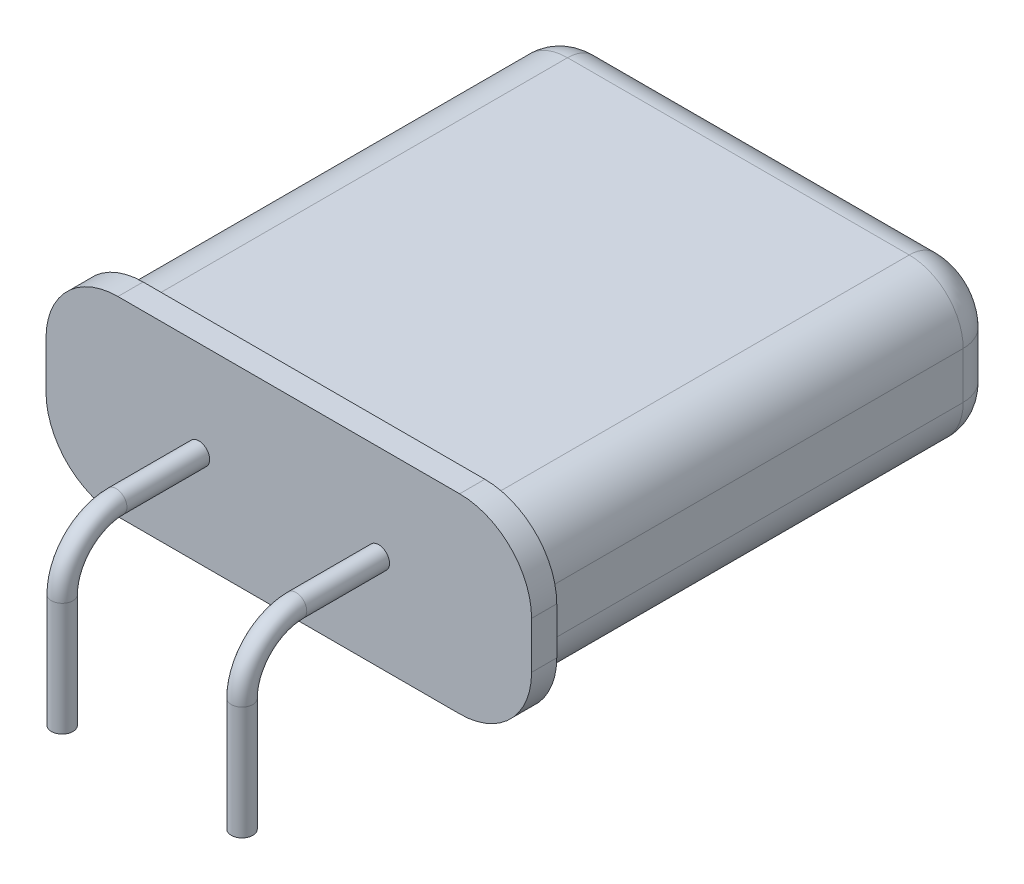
ISO-10303-21;
HEADER;
FILE_DESCRIPTION(('STEP AP214'),'2;1');
FILE_NAME('part.step','',(''),(''),'','','');
FILE_SCHEMA(('AUTOMOTIVE_DESIGN { 1 0 10303 214 1 1 1 1 }'));
ENDSEC;
DATA;
#1=APPLICATION_CONTEXT('core data for automotive mechanical design processes');
#2=APPLICATION_PROTOCOL_DEFINITION('international standard','automotive_design',2000,#1);
#3=PRODUCT_CONTEXT('',#1,'mechanical');
#4=PRODUCT('Part','Part','',(#3));
#5=PRODUCT_RELATED_PRODUCT_CATEGORY('part','',(#4));
#6=PRODUCT_DEFINITION_FORMATION('','',#4);
#7=PRODUCT_DEFINITION_CONTEXT('part definition',#1,'design');
#8=PRODUCT_DEFINITION('design','',#6,#7);
#9=PRODUCT_DEFINITION_SHAPE('','',#8);
#10=(LENGTH_UNIT() NAMED_UNIT(*) SI_UNIT(.MILLI.,.METRE.));
#11=(NAMED_UNIT(*) PLANE_ANGLE_UNIT() SI_UNIT($,.RADIAN.));
#12=(NAMED_UNIT(*) SI_UNIT($,.STERADIAN.) SOLID_ANGLE_UNIT());
#13=UNCERTAINTY_MEASURE_WITH_UNIT(LENGTH_MEASURE(1.E-05),#10,'distance_accuracy_value','');
#14=(GEOMETRIC_REPRESENTATION_CONTEXT(3) GLOBAL_UNCERTAINTY_ASSIGNED_CONTEXT((#13)) GLOBAL_UNIT_ASSIGNED_CONTEXT((#10,
#11,#12)) REPRESENTATION_CONTEXT('',''));
#15=CARTESIAN_POINT('',(0.,0.,0.));
#16=DIRECTION('',(0.,0.,1.));
#17=DIRECTION('',(1.,0.,0.));
#18=AXIS2_PLACEMENT_3D('',#15,#16,#17);
#19=CARTESIAN_POINT('',(2.,3.3,0.));
#20=DIRECTION('',(0.,0.,-1.));
#21=DIRECTION('',(-1.,0.,0.));
#22=AXIS2_PLACEMENT_3D('',#19,#20,#21);
#23=PLANE('',#22);
#24=CARTESIAN_POINT('',(9.25,2.65,0.));
#25=DIRECTION('',(0.,0.,1.));
#26=DIRECTION('',(1.,0.,0.));
#27=AXIS2_PLACEMENT_3D('',#24,#25,#26);
#28=CIRCLE('',#27,0.3);
#29=CARTESIAN_POINT('',(9.55,2.65,0.));
#30=VERTEX_POINT('',#29);
#31=EDGE_CURVE('E47',#30,#30,#28,.T.);
#32=ORIENTED_EDGE('',*,*,#31,.F.);
#33=EDGE_LOOP('',(#32));
#34=FACE_BOUND('',#33,.T.);
#35=CARTESIAN_POINT('',(2.,3.3,0.));
#36=DIRECTION('',(0.,0.,1.));
#37=DIRECTION('',(-1.,0.,0.));
#38=AXIS2_PLACEMENT_3D('',#35,#36,#37);
#39=CIRCLE('',#38,2.);
#40=CARTESIAN_POINT('',(2.,5.3,0.));
#41=VERTEX_POINT('',#40);
#42=CARTESIAN_POINT('',(0.,3.3,0.));
#43=VERTEX_POINT('',#42);
#44=EDGE_CURVE('E189',#41,#43,#39,.T.);
#45=ORIENTED_EDGE('',*,*,#44,.T.);
#46=DIRECTION('',(0.,-1.,0.));
#47=VECTOR('',#46,1.);
#48=CARTESIAN_POINT('',(0.,2.,0.));
#49=LINE('',#48,#47);
#50=CARTESIAN_POINT('',(0.,2.,0.));
#51=VERTEX_POINT('',#50);
#52=EDGE_CURVE('E256',#43,#51,#49,.T.);
#53=ORIENTED_EDGE('',*,*,#52,.T.);
#54=CARTESIAN_POINT('',(2.,2.,0.));
#55=DIRECTION('',(0.,0.,1.));
#56=DIRECTION('',(-1.,0.,0.));
#57=AXIS2_PLACEMENT_3D('',#54,#55,#56);
#58=CIRCLE('',#57,2.);
#59=CARTESIAN_POINT('',(2.,0.,0.));
#60=VERTEX_POINT('',#59);
#61=EDGE_CURVE('E260',#51,#60,#58,.T.);
#62=ORIENTED_EDGE('',*,*,#61,.T.);
#63=DIRECTION('',(1.,0.,0.));
#64=VECTOR('',#63,1.);
#65=CARTESIAN_POINT('',(2.,0.,0.));
#66=LINE('',#65,#64);
#67=CARTESIAN_POINT('',(11.5,0.,0.));
#68=VERTEX_POINT('',#67);
#69=EDGE_CURVE('E264',#60,#68,#66,.T.);
#70=ORIENTED_EDGE('',*,*,#69,.T.);
#71=CARTESIAN_POINT('',(11.5,2.,0.));
#72=DIRECTION('',(0.,0.,1.));
#73=DIRECTION('',(1.,0.,0.));
#74=AXIS2_PLACEMENT_3D('',#71,#72,#73);
#75=CIRCLE('',#74,2.);
#76=CARTESIAN_POINT('',(13.5,2.,0.));
#77=VERTEX_POINT('',#76);
#78=EDGE_CURVE('E268',#68,#77,#75,.T.);
#79=ORIENTED_EDGE('',*,*,#78,.T.);
#80=DIRECTION('',(0.,1.,0.));
#81=VECTOR('',#80,1.);
#82=CARTESIAN_POINT('',(13.5,2.,0.));
#83=LINE('',#82,#81);
#84=CARTESIAN_POINT('',(13.5,3.3,0.));
#85=VERTEX_POINT('',#84);
#86=EDGE_CURVE('E272',#77,#85,#83,.T.);
#87=ORIENTED_EDGE('',*,*,#86,.T.);
#88=CARTESIAN_POINT('',(11.5,3.3,0.));
#89=DIRECTION('',(0.,0.,1.));
#90=DIRECTION('',(-1.,0.,0.));
#91=AXIS2_PLACEMENT_3D('',#88,#89,#90);
#92=CIRCLE('',#91,2.);
#93=CARTESIAN_POINT('',(11.5,5.3,0.));
#94=VERTEX_POINT('',#93);
#95=EDGE_CURVE('E276',#85,#94,#92,.T.);
#96=ORIENTED_EDGE('',*,*,#95,.T.);
#97=DIRECTION('',(-1.,0.,0.));
#98=VECTOR('',#97,1.);
#99=CARTESIAN_POINT('',(2.,5.3,0.));
#100=LINE('',#99,#98);
#101=EDGE_CURVE('E280',#94,#41,#100,.T.);
#102=ORIENTED_EDGE('',*,*,#101,.T.);
#103=EDGE_LOOP('',(#45,#53,#62,#70,#79,#87,#96,#102));
#104=FACE_BOUND('',#103,.T.);
#105=CARTESIAN_POINT('',(4.25,2.65,0.));
#106=DIRECTION('',(0.,0.,1.));
#107=DIRECTION('',(-1.,0.,0.));
#108=AXIS2_PLACEMENT_3D('',#105,#106,#107);
#109=CIRCLE('',#108,0.3);
#110=CARTESIAN_POINT('',(3.95,2.65,0.));
#111=VERTEX_POINT('',#110);
#112=EDGE_CURVE('E11',#111,#111,#109,.T.);
#113=ORIENTED_EDGE('',*,*,#112,.F.);
#114=EDGE_LOOP('',(#113));
#115=FACE_BOUND('',#114,.T.);
#116=ADVANCED_FACE('F37',(#34,#104,#115),#23,.F.);
#117=CARTESIAN_POINT('',(2.,3.3,-0.7));
#118=DIRECTION('',(0.,0.,-1.));
#119=DIRECTION('',(-1.,0.,0.));
#120=AXIS2_PLACEMENT_3D('',#117,#118,#119);
#121=PLANE('',#120);
#122=CARTESIAN_POINT('',(2.,3.3,-0.7));
#123=DIRECTION('',(0.,0.,1.));
#124=DIRECTION('',(-1.,0.,0.));
#125=AXIS2_PLACEMENT_3D('',#122,#123,#124);
#126=CIRCLE('',#125,2.);
#127=CARTESIAN_POINT('',(2.,5.3,-0.7));
#128=VERTEX_POINT('',#127);
#129=CARTESIAN_POINT('',(0.,3.3,-0.7));
#130=VERTEX_POINT('',#129);
#131=EDGE_CURVE('E284',#128,#130,#126,.T.);
#132=ORIENTED_EDGE('',*,*,#131,.F.);
#133=DIRECTION('',(-1.,0.,0.));
#134=VECTOR('',#133,1.);
#135=CARTESIAN_POINT('',(2.,5.3,-0.7));
#136=LINE('',#135,#134);
#137=CARTESIAN_POINT('',(11.5,5.3,-0.7));
#138=VERTEX_POINT('',#137);
#139=EDGE_CURVE('E312',#138,#128,#136,.T.);
#140=ORIENTED_EDGE('',*,*,#139,.F.);
#141=CARTESIAN_POINT('',(11.5,3.3,-0.7));
#142=DIRECTION('',(0.,0.,1.));
#143=DIRECTION('',(-1.,0.,0.));
#144=AXIS2_PLACEMENT_3D('',#141,#142,#143);
#145=CIRCLE('',#144,2.);
#146=CARTESIAN_POINT('',(13.5,3.3,-0.7));
#147=VERTEX_POINT('',#146);
#148=EDGE_CURVE('E308',#147,#138,#145,.T.);
#149=ORIENTED_EDGE('',*,*,#148,.F.);
#150=DIRECTION('',(0.,1.,0.));
#151=VECTOR('',#150,1.);
#152=CARTESIAN_POINT('',(13.5,2.,-0.7));
#153=LINE('',#152,#151);
#154=CARTESIAN_POINT('',(13.5,2.,-0.7));
#155=VERTEX_POINT('',#154);
#156=EDGE_CURVE('E304',#155,#147,#153,.T.);
#157=ORIENTED_EDGE('',*,*,#156,.F.);
#158=CARTESIAN_POINT('',(11.5,2.,-0.7));
#159=DIRECTION('',(0.,0.,1.));
#160=DIRECTION('',(1.,0.,0.));
#161=AXIS2_PLACEMENT_3D('',#158,#159,#160);
#162=CIRCLE('',#161,2.);
#163=CARTESIAN_POINT('',(11.5,0.,-0.7));
#164=VERTEX_POINT('',#163);
#165=EDGE_CURVE('E300',#164,#155,#162,.T.);
#166=ORIENTED_EDGE('',*,*,#165,.F.);
#167=DIRECTION('',(1.,0.,0.));
#168=VECTOR('',#167,1.);
#169=CARTESIAN_POINT('',(2.,0.,-0.7));
#170=LINE('',#169,#168);
#171=CARTESIAN_POINT('',(2.,0.,-0.7));
#172=VERTEX_POINT('',#171);
#173=EDGE_CURVE('E296',#172,#164,#170,.T.);
#174=ORIENTED_EDGE('',*,*,#173,.F.);
#175=CARTESIAN_POINT('',(2.,2.,-0.7));
#176=DIRECTION('',(0.,0.,1.));
#177=DIRECTION('',(-1.,0.,0.));
#178=AXIS2_PLACEMENT_3D('',#175,#176,#177);
#179=CIRCLE('',#178,2.);
#180=CARTESIAN_POINT('',(0.,2.,-0.7));
#181=VERTEX_POINT('',#180);
#182=EDGE_CURVE('E292',#181,#172,#179,.T.);
#183=ORIENTED_EDGE('',*,*,#182,.F.);
#184=DIRECTION('',(0.,-1.,0.));
#185=VECTOR('',#184,1.);
#186=CARTESIAN_POINT('',(0.,2.,-0.7));
#187=LINE('',#186,#185);
#188=EDGE_CURVE('E288',#130,#181,#187,.T.);
#189=ORIENTED_EDGE('',*,*,#188,.F.);
#190=EDGE_LOOP('',(#132,#140,#149,#157,#166,#174,#183,#189));
#191=FACE_BOUND('',#190,.T.);
#192=DIRECTION('',(1.,0.,0.));
#193=VECTOR('',#192,1.);
#194=CARTESIAN_POINT('',(2.,4.8,-0.7));
#195=LINE('',#194,#193);
#196=CARTESIAN_POINT('',(2.,4.8,-0.7));
#197=VERTEX_POINT('',#196);
#198=CARTESIAN_POINT('',(11.5,4.8,-0.7));
#199=VERTEX_POINT('',#198);
#200=EDGE_CURVE('E182',#197,#199,#195,.T.);
#201=ORIENTED_EDGE('',*,*,#200,.F.);
#202=CARTESIAN_POINT('',(2.,3.3,-0.7));
#203=DIRECTION('',(0.,0.,-1.));
#204=DIRECTION('',(-1.,0.,0.));
#205=AXIS2_PLACEMENT_3D('',#202,#203,#204);
#206=CIRCLE('',#205,1.5);
#207=CARTESIAN_POINT('',(0.5,3.3,-0.7));
#208=VERTEX_POINT('',#207);
#209=EDGE_CURVE('E193',#208,#197,#206,.T.);
#210=ORIENTED_EDGE('',*,*,#209,.F.);
#211=DIRECTION('',(0.,1.,0.));
#212=VECTOR('',#211,1.);
#213=CARTESIAN_POINT('',(0.5,2.,-0.7));
#214=LINE('',#213,#212);
#215=CARTESIAN_POINT('',(0.5,2.,-0.7));
#216=VERTEX_POINT('',#215);
#217=EDGE_CURVE('E231',#216,#208,#214,.T.);
#218=ORIENTED_EDGE('',*,*,#217,.F.);
#219=CARTESIAN_POINT('',(2.,2.,-0.7));
#220=DIRECTION('',(0.,0.,-1.));
#221=DIRECTION('',(-1.,0.,0.));
#222=AXIS2_PLACEMENT_3D('',#219,#220,#221);
#223=CIRCLE('',#222,1.5);
#224=CARTESIAN_POINT('',(2.,0.5,-0.7));
#225=VERTEX_POINT('',#224);
#226=EDGE_CURVE('E227',#225,#216,#223,.T.);
#227=ORIENTED_EDGE('',*,*,#226,.F.);
#228=DIRECTION('',(-1.,0.,0.));
#229=VECTOR('',#228,1.);
#230=CARTESIAN_POINT('',(11.5,0.499999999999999,-0.7));
#231=LINE('',#230,#229);
#232=CARTESIAN_POINT('',(11.5,0.499999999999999,-0.7));
#233=VERTEX_POINT('',#232);
#234=EDGE_CURVE('E223',#233,#225,#231,.T.);
#235=ORIENTED_EDGE('',*,*,#234,.F.);
#236=CARTESIAN_POINT('',(11.5,2.,-0.7));
#237=DIRECTION('',(0.,0.,-1.));
#238=DIRECTION('',(-1.,0.,0.));
#239=AXIS2_PLACEMENT_3D('',#236,#237,#238);
#240=CIRCLE('',#239,1.5);
#241=CARTESIAN_POINT('',(13.,2.,-0.7));
#242=VERTEX_POINT('',#241);
#243=EDGE_CURVE('E219',#242,#233,#240,.T.);
#244=ORIENTED_EDGE('',*,*,#243,.F.);
#245=DIRECTION('',(0.,-1.,0.));
#246=VECTOR('',#245,1.);
#247=CARTESIAN_POINT('',(13.,3.3,-0.7));
#248=LINE('',#247,#246);
#249=CARTESIAN_POINT('',(13.,3.3,-0.7));
#250=VERTEX_POINT('',#249);
#251=EDGE_CURVE('E212',#250,#242,#248,.T.);
#252=ORIENTED_EDGE('',*,*,#251,.F.);
#253=CARTESIAN_POINT('',(11.5,3.3,-0.7));
#254=DIRECTION('',(0.,0.,-1.));
#255=DIRECTION('',(-1.,0.,0.));
#256=AXIS2_PLACEMENT_3D('',#253,#254,#255);
#257=CIRCLE('',#256,1.5);
#258=EDGE_CURVE('E206',#199,#250,#257,.T.);
#259=ORIENTED_EDGE('',*,*,#258,.F.);
#260=EDGE_LOOP('',(#201,#210,#218,#227,#235,#244,#252,#259));
#261=FACE_BOUND('',#260,.T.);
#262=ADVANCED_FACE('F203',(#191,#261),#121,.T.);
#263=CARTESIAN_POINT('',(2.,3.3,-0.7));
#264=DIRECTION('',(0.,0.,1.));
#265=DIRECTION('',(1.,0.,0.));
#266=AXIS2_PLACEMENT_3D('',#263,#264,#265);
#267=CYLINDRICAL_SURFACE('',#266,2.);
#268=ORIENTED_EDGE('',*,*,#44,.F.);
#269=DIRECTION('',(0.,0.,1.));
#270=VECTOR('',#269,1.);
#271=CARTESIAN_POINT('',(2.,5.3,-0.7));
#272=LINE('',#271,#270);
#273=EDGE_CURVE('E317',#128,#41,#272,.T.);
#274=ORIENTED_EDGE('',*,*,#273,.F.);
#275=ORIENTED_EDGE('',*,*,#131,.T.);
#276=DIRECTION('',(0.,0.,1.));
#277=VECTOR('',#276,1.);
#278=CARTESIAN_POINT('',(0.,3.3,-0.7));
#279=LINE('',#278,#277);
#280=EDGE_CURVE('E316',#130,#43,#279,.T.);
#281=ORIENTED_EDGE('',*,*,#280,.T.);
#282=EDGE_LOOP('',(#268,#274,#275,#281));
#283=FACE_BOUND('',#282,.T.);
#284=ADVANCED_FACE('F39',(#283),#267,.T.);
#285=CARTESIAN_POINT('',(2.,5.3,-0.7));
#286=DIRECTION('',(0.,1.,0.));
#287=DIRECTION('',(-1.,0.,0.));
#288=AXIS2_PLACEMENT_3D('',#285,#286,#287);
#289=PLANE('',#288);
#290=ORIENTED_EDGE('',*,*,#101,.F.);
#291=DIRECTION('',(0.,0.,1.));
#292=VECTOR('',#291,1.);
#293=CARTESIAN_POINT('',(11.5,5.3,-0.7));
#294=LINE('',#293,#292);
#295=EDGE_CURVE('E321',#138,#94,#294,.T.);
#296=ORIENTED_EDGE('',*,*,#295,.F.);
#297=ORIENTED_EDGE('',*,*,#139,.T.);
#298=ORIENTED_EDGE('',*,*,#273,.T.);
#299=EDGE_LOOP('',(#290,#296,#297,#298));
#300=FACE_BOUND('',#299,.T.);
#301=ADVANCED_FACE('F500',(#300),#289,.T.);
#302=CARTESIAN_POINT('',(11.5,3.3,-0.7));
#303=DIRECTION('',(0.,0.,1.));
#304=DIRECTION('',(1.,0.,0.));
#305=AXIS2_PLACEMENT_3D('',#302,#303,#304);
#306=CYLINDRICAL_SURFACE('',#305,2.);
#307=ORIENTED_EDGE('',*,*,#95,.F.);
#308=DIRECTION('',(0.,0.,1.));
#309=VECTOR('',#308,1.);
#310=CARTESIAN_POINT('',(13.5,3.3,-0.7));
#311=LINE('',#310,#309);
#312=EDGE_CURVE('E324',#147,#85,#311,.T.);
#313=ORIENTED_EDGE('',*,*,#312,.F.);
#314=ORIENTED_EDGE('',*,*,#148,.T.);
#315=ORIENTED_EDGE('',*,*,#295,.T.);
#316=EDGE_LOOP('',(#307,#313,#314,#315));
#317=FACE_BOUND('',#316,.T.);
#318=ADVANCED_FACE('F503',(#317),#306,.T.);
#319=CARTESIAN_POINT('',(13.5,2.,-0.7));
#320=DIRECTION('',(1.,0.,0.));
#321=DIRECTION('',(0.,0.,-1.));
#322=AXIS2_PLACEMENT_3D('',#319,#320,#321);
#323=PLANE('',#322);
#324=ORIENTED_EDGE('',*,*,#86,.F.);
#325=DIRECTION('',(0.,0.,1.));
#326=VECTOR('',#325,1.);
#327=CARTESIAN_POINT('',(13.5,2.,-0.7));
#328=LINE('',#327,#326);
#329=EDGE_CURVE('E327',#155,#77,#328,.T.);
#330=ORIENTED_EDGE('',*,*,#329,.F.);
#331=ORIENTED_EDGE('',*,*,#156,.T.);
#332=ORIENTED_EDGE('',*,*,#312,.T.);
#333=EDGE_LOOP('',(#324,#330,#331,#332));
#334=FACE_BOUND('',#333,.T.);
#335=ADVANCED_FACE('F507',(#334),#323,.T.);
#336=CARTESIAN_POINT('',(11.5,2.,-0.7));
#337=DIRECTION('',(0.,0.,1.));
#338=DIRECTION('',(1.,0.,0.));
#339=AXIS2_PLACEMENT_3D('',#336,#337,#338);
#340=CYLINDRICAL_SURFACE('',#339,2.);
#341=ORIENTED_EDGE('',*,*,#78,.F.);
#342=DIRECTION('',(0.,0.,1.));
#343=VECTOR('',#342,1.);
#344=CARTESIAN_POINT('',(11.5,0.,-0.7));
#345=LINE('',#344,#343);
#346=EDGE_CURVE('E330',#164,#68,#345,.T.);
#347=ORIENTED_EDGE('',*,*,#346,.F.);
#348=ORIENTED_EDGE('',*,*,#165,.T.);
#349=ORIENTED_EDGE('',*,*,#329,.T.);
#350=EDGE_LOOP('',(#341,#347,#348,#349));
#351=FACE_BOUND('',#350,.T.);
#352=ADVANCED_FACE('F511',(#351),#340,.T.);
#353=CARTESIAN_POINT('',(2.,0.,-0.7));
#354=DIRECTION('',(0.,-1.,0.));
#355=DIRECTION('',(0.,0.,-1.));
#356=AXIS2_PLACEMENT_3D('',#353,#354,#355);
#357=PLANE('',#356);
#358=ORIENTED_EDGE('',*,*,#69,.F.);
#359=DIRECTION('',(0.,0.,1.));
#360=VECTOR('',#359,1.);
#361=CARTESIAN_POINT('',(2.,0.,-0.7));
#362=LINE('',#361,#360);
#363=EDGE_CURVE('E333',#172,#60,#362,.T.);
#364=ORIENTED_EDGE('',*,*,#363,.F.);
#365=ORIENTED_EDGE('',*,*,#173,.T.);
#366=ORIENTED_EDGE('',*,*,#346,.T.);
#367=EDGE_LOOP('',(#358,#364,#365,#366));
#368=FACE_BOUND('',#367,.T.);
#369=ADVANCED_FACE('F515',(#368),#357,.T.);
#370=CARTESIAN_POINT('',(2.,2.,-0.7));
#371=DIRECTION('',(0.,0.,1.));
#372=DIRECTION('',(1.,0.,0.));
#373=AXIS2_PLACEMENT_3D('',#370,#371,#372);
#374=CYLINDRICAL_SURFACE('',#373,2.);
#375=ORIENTED_EDGE('',*,*,#61,.F.);
#376=DIRECTION('',(0.,0.,1.));
#377=VECTOR('',#376,1.);
#378=CARTESIAN_POINT('',(0.,2.,-0.7));
#379=LINE('',#378,#377);
#380=EDGE_CURVE('E336',#181,#51,#379,.T.);
#381=ORIENTED_EDGE('',*,*,#380,.F.);
#382=ORIENTED_EDGE('',*,*,#182,.T.);
#383=ORIENTED_EDGE('',*,*,#363,.T.);
#384=EDGE_LOOP('',(#375,#381,#382,#383));
#385=FACE_BOUND('',#384,.T.);
#386=ADVANCED_FACE('F519',(#385),#374,.T.);
#387=CARTESIAN_POINT('',(0.,2.,-0.7));
#388=DIRECTION('',(-1.,0.,0.));
#389=DIRECTION('',(0.,0.,1.));
#390=AXIS2_PLACEMENT_3D('',#387,#388,#389);
#391=PLANE('',#390);
#392=ORIENTED_EDGE('',*,*,#52,.F.);
#393=ORIENTED_EDGE('',*,*,#280,.F.);
#394=ORIENTED_EDGE('',*,*,#188,.T.);
#395=ORIENTED_EDGE('',*,*,#380,.T.);
#396=EDGE_LOOP('',(#392,#393,#394,#395));
#397=FACE_BOUND('',#396,.T.);
#398=ADVANCED_FACE('F522',(#397),#391,.T.);
#399=CARTESIAN_POINT('',(2.,3.3,-13.5));
#400=DIRECTION('',(0.,0.,1.));
#401=DIRECTION('',(1.,0.,0.));
#402=AXIS2_PLACEMENT_3D('',#399,#400,#401);
#403=CYLINDRICAL_SURFACE('',#402,1.5);
#404=DIRECTION('',(0.,0.,1.));
#405=VECTOR('',#404,1.);
#406=CARTESIAN_POINT('',(2.,4.8,-13.5));
#407=LINE('',#406,#405);
#408=CARTESIAN_POINT('',(2.,4.8,-12.5));
#409=VERTEX_POINT('',#408);
#410=EDGE_CURVE('E178',#409,#197,#407,.T.);
#411=ORIENTED_EDGE('',*,*,#410,.F.);
#412=CARTESIAN_POINT('',(2.,3.3,-12.5));
#413=DIRECTION('',(0.,0.,-1.));
#414=DIRECTION('',(-1.,0.,0.));
#415=AXIS2_PLACEMENT_3D('',#412,#413,#414);
#416=CIRCLE('',#415,1.5);
#417=CARTESIAN_POINT('',(0.5,3.3,-12.5));
#418=VERTEX_POINT('',#417);
#419=EDGE_CURVE('E365',#409,#418,#416,.F.);
#420=ORIENTED_EDGE('',*,*,#419,.T.);
#421=DIRECTION('',(0.,0.,1.));
#422=VECTOR('',#421,1.);
#423=CARTESIAN_POINT('',(0.5,3.3,-13.5));
#424=LINE('',#423,#422);
#425=EDGE_CURVE('E196',#418,#208,#424,.T.);
#426=ORIENTED_EDGE('',*,*,#425,.T.);
#427=ORIENTED_EDGE('',*,*,#209,.T.);
#428=EDGE_LOOP('',(#411,#420,#426,#427));
#429=FACE_BOUND('',#428,.T.);
#430=ADVANCED_FACE('F194',(#429),#403,.T.);
#431=CARTESIAN_POINT('',(2.,4.8,-13.5));
#432=DIRECTION('',(0.,-1.,0.));
#433=DIRECTION('',(0.,0.,-1.));
#434=AXIS2_PLACEMENT_3D('',#431,#432,#433);
#435=PLANE('',#434);
#436=DIRECTION('',(0.,0.,1.));
#437=VECTOR('',#436,1.);
#438=CARTESIAN_POINT('',(11.5,4.8,-13.5));
#439=LINE('',#438,#437);
#440=CARTESIAN_POINT('',(11.5,4.8,-12.5));
#441=VERTEX_POINT('',#440);
#442=EDGE_CURVE('E190',#441,#199,#439,.T.);
#443=ORIENTED_EDGE('',*,*,#442,.F.);
#444=DIRECTION('',(1.,0.,0.));
#445=VECTOR('',#444,1.);
#446=CARTESIAN_POINT('',(2.,4.8,-12.5));
#447=LINE('',#446,#445);
#448=EDGE_CURVE('E41',#441,#409,#447,.F.);
#449=ORIENTED_EDGE('',*,*,#448,.T.);
#450=ORIENTED_EDGE('',*,*,#410,.T.);
#451=ORIENTED_EDGE('',*,*,#200,.T.);
#452=EDGE_LOOP('',(#443,#449,#450,#451));
#453=FACE_BOUND('',#452,.T.);
#454=ADVANCED_FACE('F180',(#453),#435,.F.);
#455=CARTESIAN_POINT('',(11.5,3.3,-13.5));
#456=DIRECTION('',(0.,0.,1.));
#457=DIRECTION('',(1.,0.,0.));
#458=AXIS2_PLACEMENT_3D('',#455,#456,#457);
#459=CYLINDRICAL_SURFACE('',#458,1.5);
#460=DIRECTION('',(0.,0.,1.));
#461=VECTOR('',#460,1.);
#462=CARTESIAN_POINT('',(13.,3.3,-13.5));
#463=LINE('',#462,#461);
#464=CARTESIAN_POINT('',(13.,3.3,-12.5));
#465=VERTEX_POINT('',#464);
#466=EDGE_CURVE('E248',#465,#250,#463,.T.);
#467=ORIENTED_EDGE('',*,*,#466,.F.);
#468=CARTESIAN_POINT('',(11.5,3.3,-12.5));
#469=DIRECTION('',(0.,0.,-1.));
#470=DIRECTION('',(-1.,0.,0.));
#471=AXIS2_PLACEMENT_3D('',#468,#469,#470);
#472=CIRCLE('',#471,1.5);
#473=EDGE_CURVE('E55',#465,#441,#472,.F.);
#474=ORIENTED_EDGE('',*,*,#473,.T.);
#475=ORIENTED_EDGE('',*,*,#442,.T.);
#476=ORIENTED_EDGE('',*,*,#258,.T.);
#477=EDGE_LOOP('',(#467,#474,#475,#476));
#478=FACE_BOUND('',#477,.T.);
#479=ADVANCED_FACE('F586',(#478),#459,.T.);
#480=CARTESIAN_POINT('',(13.,3.3,-13.5));
#481=DIRECTION('',(-1.,0.,0.));
#482=DIRECTION('',(0.,0.,1.));
#483=AXIS2_PLACEMENT_3D('',#480,#481,#482);
#484=PLANE('',#483);
#485=DIRECTION('',(0.,0.,1.));
#486=VECTOR('',#485,1.);
#487=CARTESIAN_POINT('',(13.,2.,-13.5));
#488=LINE('',#487,#486);
#489=CARTESIAN_POINT('',(13.,2.,-12.5));
#490=VERTEX_POINT('',#489);
#491=EDGE_CURVE('E245',#490,#242,#488,.T.);
#492=ORIENTED_EDGE('',*,*,#491,.F.);
#493=DIRECTION('',(0.,-1.,0.));
#494=VECTOR('',#493,1.);
#495=CARTESIAN_POINT('',(13.,3.3,-12.5));
#496=LINE('',#495,#494);
#497=EDGE_CURVE('E63',#490,#465,#496,.F.);
#498=ORIENTED_EDGE('',*,*,#497,.T.);
#499=ORIENTED_EDGE('',*,*,#466,.T.);
#500=ORIENTED_EDGE('',*,*,#251,.T.);
#501=EDGE_LOOP('',(#492,#498,#499,#500));
#502=FACE_BOUND('',#501,.T.);
#503=ADVANCED_FACE('F441',(#502),#484,.F.);
#504=CARTESIAN_POINT('',(11.5,2.,-13.5));
#505=DIRECTION('',(0.,0.,1.));
#506=DIRECTION('',(1.,0.,0.));
#507=AXIS2_PLACEMENT_3D('',#504,#505,#506);
#508=CYLINDRICAL_SURFACE('',#507,1.5);
#509=DIRECTION('',(0.,0.,1.));
#510=VECTOR('',#509,1.);
#511=CARTESIAN_POINT('',(11.5,0.499999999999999,-13.5));
#512=LINE('',#511,#510);
#513=CARTESIAN_POINT('',(11.5,0.499999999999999,-12.5));
#514=VERTEX_POINT('',#513);
#515=EDGE_CURVE('E242',#514,#233,#512,.T.);
#516=ORIENTED_EDGE('',*,*,#515,.F.);
#517=CARTESIAN_POINT('',(11.5,2.,-12.5));
#518=DIRECTION('',(0.,0.,-1.));
#519=DIRECTION('',(-1.,0.,0.));
#520=AXIS2_PLACEMENT_3D('',#517,#518,#519);
#521=CIRCLE('',#520,1.5);
#522=EDGE_CURVE('E377',#514,#490,#521,.F.);
#523=ORIENTED_EDGE('',*,*,#522,.T.);
#524=ORIENTED_EDGE('',*,*,#491,.T.);
#525=ORIENTED_EDGE('',*,*,#243,.T.);
#526=EDGE_LOOP('',(#516,#523,#524,#525));
#527=FACE_BOUND('',#526,.T.);
#528=ADVANCED_FACE('F440',(#527),#508,.T.);
#529=CARTESIAN_POINT('',(11.5,0.499999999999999,-13.5));
#530=DIRECTION('',(0.,1.,0.));
#531=DIRECTION('',(-1.,0.,0.));
#532=AXIS2_PLACEMENT_3D('',#529,#530,#531);
#533=PLANE('',#532);
#534=DIRECTION('',(0.,0.,1.));
#535=VECTOR('',#534,1.);
#536=CARTESIAN_POINT('',(2.,0.5,-13.5));
#537=LINE('',#536,#535);
#538=CARTESIAN_POINT('',(2.,0.5,-12.5));
#539=VERTEX_POINT('',#538);
#540=EDGE_CURVE('E239',#539,#225,#537,.T.);
#541=ORIENTED_EDGE('',*,*,#540,.F.);
#542=DIRECTION('',(-1.,0.,0.));
#543=VECTOR('',#542,1.);
#544=CARTESIAN_POINT('',(11.5,0.499999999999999,-12.5));
#545=LINE('',#544,#543);
#546=EDGE_CURVE('E374',#539,#514,#545,.F.);
#547=ORIENTED_EDGE('',*,*,#546,.T.);
#548=ORIENTED_EDGE('',*,*,#515,.T.);
#549=ORIENTED_EDGE('',*,*,#234,.T.);
#550=EDGE_LOOP('',(#541,#547,#548,#549));
#551=FACE_BOUND('',#550,.T.);
#552=ADVANCED_FACE('F447',(#551),#533,.F.);
#553=CARTESIAN_POINT('',(2.,2.,-13.5));
#554=DIRECTION('',(0.,0.,1.));
#555=DIRECTION('',(1.,0.,0.));
#556=AXIS2_PLACEMENT_3D('',#553,#554,#555);
#557=CYLINDRICAL_SURFACE('',#556,1.5);
#558=DIRECTION('',(0.,0.,1.));
#559=VECTOR('',#558,1.);
#560=CARTESIAN_POINT('',(0.5,2.,-13.5));
#561=LINE('',#560,#559);
#562=CARTESIAN_POINT('',(0.5,2.,-12.5));
#563=VERTEX_POINT('',#562);
#564=EDGE_CURVE('E236',#563,#216,#561,.T.);
#565=ORIENTED_EDGE('',*,*,#564,.F.);
#566=CARTESIAN_POINT('',(2.,2.,-12.5));
#567=DIRECTION('',(0.,0.,-1.));
#568=DIRECTION('',(-1.,0.,0.));
#569=AXIS2_PLACEMENT_3D('',#566,#567,#568);
#570=CIRCLE('',#569,1.5);
#571=EDGE_CURVE('E371',#563,#539,#570,.F.);
#572=ORIENTED_EDGE('',*,*,#571,.T.);
#573=ORIENTED_EDGE('',*,*,#540,.T.);
#574=ORIENTED_EDGE('',*,*,#226,.T.);
#575=EDGE_LOOP('',(#565,#572,#573,#574));
#576=FACE_BOUND('',#575,.T.);
#577=ADVANCED_FACE('F450',(#576),#557,.T.);
#578=CARTESIAN_POINT('',(0.5,2.,-13.5));
#579=DIRECTION('',(1.,0.,0.));
#580=DIRECTION('',(0.,0.,-1.));
#581=AXIS2_PLACEMENT_3D('',#578,#579,#580);
#582=PLANE('',#581);
#583=ORIENTED_EDGE('',*,*,#425,.F.);
#584=DIRECTION('',(0.,1.,0.));
#585=VECTOR('',#584,1.);
#586=CARTESIAN_POINT('',(0.5,2.,-12.5));
#587=LINE('',#586,#585);
#588=EDGE_CURVE('E368',#418,#563,#587,.F.);
#589=ORIENTED_EDGE('',*,*,#588,.T.);
#590=ORIENTED_EDGE('',*,*,#564,.T.);
#591=ORIENTED_EDGE('',*,*,#217,.T.);
#592=EDGE_LOOP('',(#583,#589,#590,#591));
#593=FACE_BOUND('',#592,.T.);
#594=ADVANCED_FACE('F479',(#593),#582,.F.);
#595=CARTESIAN_POINT('',(2.,3.3,-13.5));
#596=DIRECTION('',(0.,0.,-1.));
#597=DIRECTION('',(-1.,0.,0.));
#598=AXIS2_PLACEMENT_3D('',#595,#596,#597);
#599=PLANE('',#598);
#600=DIRECTION('',(0.,1.,0.));
#601=VECTOR('',#600,1.);
#602=CARTESIAN_POINT('',(1.5,3.3,-13.5));
#603=LINE('',#602,#601);
#604=CARTESIAN_POINT('',(1.5,2.,-13.5));
#605=VERTEX_POINT('',#604);
#606=CARTESIAN_POINT('',(1.5,3.3,-13.5));
#607=VERTEX_POINT('',#606);
#608=EDGE_CURVE('E358',#605,#607,#603,.T.);
#609=ORIENTED_EDGE('',*,*,#608,.T.);
#610=CARTESIAN_POINT('',(2.,3.3,-13.5));
#611=DIRECTION('',(0.,0.,-1.));
#612=DIRECTION('',(-1.,0.,0.));
#613=AXIS2_PLACEMENT_3D('',#610,#611,#612);
#614=CIRCLE('',#613,0.5);
#615=CARTESIAN_POINT('',(2.,3.8,-13.5));
#616=VERTEX_POINT('',#615);
#617=EDGE_CURVE('E361',#607,#616,#614,.T.);
#618=ORIENTED_EDGE('',*,*,#617,.T.);
#619=DIRECTION('',(1.,0.,0.));
#620=VECTOR('',#619,1.);
#621=CARTESIAN_POINT('',(11.5,3.8,-13.5));
#622=LINE('',#621,#620);
#623=CARTESIAN_POINT('',(11.5,3.8,-13.5));
#624=VERTEX_POINT('',#623);
#625=EDGE_CURVE('E320',#616,#624,#622,.T.);
#626=ORIENTED_EDGE('',*,*,#625,.T.);
#627=CARTESIAN_POINT('',(11.5,3.3,-13.5));
#628=DIRECTION('',(0.,0.,-1.));
#629=DIRECTION('',(-1.,0.,0.));
#630=AXIS2_PLACEMENT_3D('',#627,#628,#629);
#631=CIRCLE('',#630,0.500000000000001);
#632=CARTESIAN_POINT('',(12.,3.3,-13.5));
#633=VERTEX_POINT('',#632);
#634=EDGE_CURVE('E343',#624,#633,#631,.T.);
#635=ORIENTED_EDGE('',*,*,#634,.T.);
#636=DIRECTION('',(0.,-1.,0.));
#637=VECTOR('',#636,1.);
#638=CARTESIAN_POINT('',(12.,2.,-13.5));
#639=LINE('',#638,#637);
#640=CARTESIAN_POINT('',(12.,2.,-13.5));
#641=VERTEX_POINT('',#640);
#642=EDGE_CURVE('E346',#633,#641,#639,.T.);
#643=ORIENTED_EDGE('',*,*,#642,.T.);
#644=CARTESIAN_POINT('',(11.5,2.,-13.5));
#645=DIRECTION('',(0.,0.,-1.));
#646=DIRECTION('',(-1.,0.,0.));
#647=AXIS2_PLACEMENT_3D('',#644,#645,#646);
#648=CIRCLE('',#647,0.500000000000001);
#649=CARTESIAN_POINT('',(11.5,1.5,-13.5));
#650=VERTEX_POINT('',#649);
#651=EDGE_CURVE('E349',#641,#650,#648,.T.);
#652=ORIENTED_EDGE('',*,*,#651,.T.);
#653=DIRECTION('',(-1.,0.,0.));
#654=VECTOR('',#653,1.);
#655=CARTESIAN_POINT('',(2.,1.5,-13.5));
#656=LINE('',#655,#654);
#657=CARTESIAN_POINT('',(2.,1.5,-13.5));
#658=VERTEX_POINT('',#657);
#659=EDGE_CURVE('E352',#650,#658,#656,.T.);
#660=ORIENTED_EDGE('',*,*,#659,.T.);
#661=CARTESIAN_POINT('',(2.,2.,-13.5));
#662=DIRECTION('',(0.,0.,-1.));
#663=DIRECTION('',(-1.,0.,0.));
#664=AXIS2_PLACEMENT_3D('',#661,#662,#663);
#665=CIRCLE('',#664,0.5);
#666=EDGE_CURVE('E355',#658,#605,#665,.T.);
#667=ORIENTED_EDGE('',*,*,#666,.T.);
#668=EDGE_LOOP('',(#609,#618,#626,#635,#643,#652,#660,#667));
#669=FACE_BOUND('',#668,.T.);
#670=ADVANCED_FACE('F463',(#669),#599,.T.);
#671=CARTESIAN_POINT('',(11.5,2.,-12.5));
#672=DIRECTION('',(0.,0.,-1.));
#673=DIRECTION('',(-1.,0.,0.));
#674=AXIS2_PLACEMENT_3D('',#671,#672,#673);
#675=DEGENERATE_TOROIDAL_SURFACE('',#674,0.500000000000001,1.,.T.);
#676=CARTESIAN_POINT('',(12.,2.,-12.5));
#677=DIRECTION('',(0.,1.,0.));
#678=DIRECTION('',(-1.,0.,0.));
#679=AXIS2_PLACEMENT_3D('',#676,#677,#678);
#680=CIRCLE('',#679,1.);
#681=EDGE_CURVE('E422',#490,#641,#680,.T.);
#682=ORIENTED_EDGE('',*,*,#681,.F.);
#683=ORIENTED_EDGE('',*,*,#522,.F.);
#684=CARTESIAN_POINT('',(11.5,1.5,-12.5));
#685=DIRECTION('',(-1.,0.,0.));
#686=DIRECTION('',(0.,0.,1.));
#687=AXIS2_PLACEMENT_3D('',#684,#685,#686);
#688=CIRCLE('',#687,1.);
#689=EDGE_CURVE('E201',#650,#514,#688,.T.);
#690=ORIENTED_EDGE('',*,*,#689,.F.);
#691=ORIENTED_EDGE('',*,*,#651,.F.);
#692=EDGE_LOOP('',(#682,#683,#690,#691));
#693=FACE_BOUND('',#692,.T.);
#694=ADVANCED_FACE('F437',(#693),#675,.T.);
#695=CARTESIAN_POINT('',(2.,1.5,-12.5));
#696=DIRECTION('',(1.,0.,0.));
#697=DIRECTION('',(0.,1.,0.));
#698=AXIS2_PLACEMENT_3D('',#695,#696,#697);
#699=CYLINDRICAL_SURFACE('',#698,1.);
#700=ORIENTED_EDGE('',*,*,#689,.T.);
#701=ORIENTED_EDGE('',*,*,#546,.F.);
#702=CARTESIAN_POINT('',(2.,1.5,-12.5));
#703=DIRECTION('',(-1.,0.,0.));
#704=DIRECTION('',(0.,-1.,0.));
#705=AXIS2_PLACEMENT_3D('',#702,#703,#704);
#706=CIRCLE('',#705,1.);
#707=EDGE_CURVE('E418',#658,#539,#706,.T.);
#708=ORIENTED_EDGE('',*,*,#707,.F.);
#709=ORIENTED_EDGE('',*,*,#659,.F.);
#710=EDGE_LOOP('',(#700,#701,#708,#709));
#711=FACE_BOUND('',#710,.T.);
#712=ADVANCED_FACE('F431',(#711),#699,.T.);
#713=CARTESIAN_POINT('',(12.,3.3,-12.5));
#714=DIRECTION('',(0.,1.,0.));
#715=DIRECTION('',(0.,0.,1.));
#716=AXIS2_PLACEMENT_3D('',#713,#714,#715);
#717=CYLINDRICAL_SURFACE('',#716,1.);
#718=ORIENTED_EDGE('',*,*,#681,.T.);
#719=ORIENTED_EDGE('',*,*,#642,.F.);
#720=CARTESIAN_POINT('',(12.,3.3,-12.5));
#721=DIRECTION('',(0.,1.,0.));
#722=DIRECTION('',(0.,0.,1.));
#723=AXIS2_PLACEMENT_3D('',#720,#721,#722);
#724=CIRCLE('',#723,1.);
#725=EDGE_CURVE('E414',#465,#633,#724,.T.);
#726=ORIENTED_EDGE('',*,*,#725,.F.);
#727=ORIENTED_EDGE('',*,*,#497,.F.);
#728=EDGE_LOOP('',(#718,#719,#726,#727));
#729=FACE_BOUND('',#728,.T.);
#730=ADVANCED_FACE('F468',(#729),#717,.T.);
#731=CARTESIAN_POINT('',(2.,2.,-12.5));
#732=DIRECTION('',(0.,0.,-1.));
#733=DIRECTION('',(-1.,0.,0.));
#734=AXIS2_PLACEMENT_3D('',#731,#732,#733);
#735=DEGENERATE_TOROIDAL_SURFACE('',#734,0.5,1.,.T.);
#736=ORIENTED_EDGE('',*,*,#707,.T.);
#737=ORIENTED_EDGE('',*,*,#571,.F.);
#738=CARTESIAN_POINT('',(1.5,2.,-12.5));
#739=DIRECTION('',(0.,1.,0.));
#740=DIRECTION('',(0.,0.,1.));
#741=AXIS2_PLACEMENT_3D('',#738,#739,#740);
#742=CIRCLE('',#741,1.);
#743=EDGE_CURVE('E410',#605,#563,#742,.T.);
#744=ORIENTED_EDGE('',*,*,#743,.F.);
#745=ORIENTED_EDGE('',*,*,#666,.F.);
#746=EDGE_LOOP('',(#736,#737,#744,#745));
#747=FACE_BOUND('',#746,.T.);
#748=ADVANCED_FACE('F454',(#747),#735,.T.);
#749=CARTESIAN_POINT('',(11.5,3.3,-12.5));
#750=DIRECTION('',(0.,0.,-1.));
#751=DIRECTION('',(-1.,0.,0.));
#752=AXIS2_PLACEMENT_3D('',#749,#750,#751);
#753=DEGENERATE_TOROIDAL_SURFACE('',#752,0.500000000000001,1.,.T.);
#754=ORIENTED_EDGE('',*,*,#725,.T.);
#755=ORIENTED_EDGE('',*,*,#634,.F.);
#756=CARTESIAN_POINT('',(11.5,3.8,-12.5));
#757=DIRECTION('',(-1.,0.,0.));
#758=DIRECTION('',(0.,0.,1.));
#759=AXIS2_PLACEMENT_3D('',#756,#757,#758);
#760=CIRCLE('',#759,1.);
#761=EDGE_CURVE('E406',#441,#624,#760,.T.);
#762=ORIENTED_EDGE('',*,*,#761,.F.);
#763=ORIENTED_EDGE('',*,*,#473,.F.);
#764=EDGE_LOOP('',(#754,#755,#762,#763));
#765=FACE_BOUND('',#764,.T.);
#766=ADVANCED_FACE('F470',(#765),#753,.T.);
#767=CARTESIAN_POINT('',(1.5,3.3,-12.5));
#768=DIRECTION('',(0.,-1.,0.));
#769=DIRECTION('',(0.,0.,-1.));
#770=AXIS2_PLACEMENT_3D('',#767,#768,#769);
#771=CYLINDRICAL_SURFACE('',#770,1.);
#772=ORIENTED_EDGE('',*,*,#743,.T.);
#773=ORIENTED_EDGE('',*,*,#588,.F.);
#774=CARTESIAN_POINT('',(1.5,3.3,-12.5));
#775=DIRECTION('',(0.,1.,0.));
#776=DIRECTION('',(0.,0.,1.));
#777=AXIS2_PLACEMENT_3D('',#774,#775,#776);
#778=CIRCLE('',#777,1.);
#779=EDGE_CURVE('E403',#607,#418,#778,.T.);
#780=ORIENTED_EDGE('',*,*,#779,.F.);
#781=ORIENTED_EDGE('',*,*,#608,.F.);
#782=EDGE_LOOP('',(#772,#773,#780,#781));
#783=FACE_BOUND('',#782,.T.);
#784=ADVANCED_FACE('F459',(#783),#771,.T.);
#785=CARTESIAN_POINT('',(2.,3.8,-12.5));
#786=DIRECTION('',(-1.,0.,0.));
#787=DIRECTION('',(0.,0.,1.));
#788=AXIS2_PLACEMENT_3D('',#785,#786,#787);
#789=CYLINDRICAL_SURFACE('',#788,1.);
#790=ORIENTED_EDGE('',*,*,#761,.T.);
#791=ORIENTED_EDGE('',*,*,#625,.F.);
#792=CARTESIAN_POINT('',(2.,3.8,-12.5));
#793=DIRECTION('',(-1.,0.,0.));
#794=DIRECTION('',(0.,0.,1.));
#795=AXIS2_PLACEMENT_3D('',#792,#793,#794);
#796=CIRCLE('',#795,1.);
#797=EDGE_CURVE('E400',#409,#616,#796,.T.);
#798=ORIENTED_EDGE('',*,*,#797,.F.);
#799=ORIENTED_EDGE('',*,*,#448,.F.);
#800=EDGE_LOOP('',(#790,#791,#798,#799));
#801=FACE_BOUND('',#800,.T.);
#802=ADVANCED_FACE('F475',(#801),#789,.T.);
#803=CARTESIAN_POINT('',(2.,3.3,-12.5));
#804=DIRECTION('',(0.,0.,-1.));
#805=DIRECTION('',(-1.,0.,0.));
#806=AXIS2_PLACEMENT_3D('',#803,#804,#805);
#807=DEGENERATE_TOROIDAL_SURFACE('',#806,0.5,1.,.T.);
#808=ORIENTED_EDGE('',*,*,#779,.T.);
#809=ORIENTED_EDGE('',*,*,#419,.F.);
#810=ORIENTED_EDGE('',*,*,#797,.T.);
#811=ORIENTED_EDGE('',*,*,#617,.F.);
#812=EDGE_LOOP('',(#808,#809,#810,#811));
#813=FACE_BOUND('',#812,.T.);
#814=ADVANCED_FACE('F477',(#813),#807,.T.);
#815=CARTESIAN_POINT('',(9.25,1.15,3.8));
#816=DIRECTION('',(0.,-1.,0.));
#817=DIRECTION('',(0.,0.,-1.));
#818=AXIS2_PLACEMENT_3D('',#815,#816,#817);
#819=CYLINDRICAL_SURFACE('',#818,0.3);
#820=CARTESIAN_POINT('',(9.25,1.15,3.8));
#821=DIRECTION('',(0.,-1.,0.));
#822=DIRECTION('',(1.,0.,0.));
#823=AXIS2_PLACEMENT_3D('',#820,#821,#822);
#824=CIRCLE('',#823,0.3);
#825=CARTESIAN_POINT('',(9.25,1.15,4.1));
#826=VERTEX_POINT('',#825);
#827=EDGE_CURVE('E392',#826,#826,#824,.T.);
#828=ORIENTED_EDGE('',*,*,#827,.T.);
#829=EDGE_LOOP('',(#828));
#830=FACE_BOUND('',#829,.T.);
#831=CARTESIAN_POINT('',(9.25,-2.,3.8));
#832=DIRECTION('',(0.,-1.,0.));
#833=DIRECTION('',(1.,0.,0.));
#834=AXIS2_PLACEMENT_3D('',#831,#832,#833);
#835=CIRCLE('',#834,0.3);
#836=CARTESIAN_POINT('',(9.55,-2.,3.8));
#837=VERTEX_POINT('',#836);
#838=EDGE_CURVE('E396',#837,#837,#835,.T.);
#839=ORIENTED_EDGE('',*,*,#838,.F.);
#840=EDGE_LOOP('',(#839));
#841=FACE_BOUND('',#840,.T.);
#842=ADVANCED_FACE('F683',(#830,#841),#819,.T.);
#843=CARTESIAN_POINT('',(9.25,1.15,2.3));
#844=DIRECTION('',(1.,0.,0.));
#845=DIRECTION('',(0.,0.,-1.));
#846=AXIS2_PLACEMENT_3D('',#843,#844,#845);
#847=TOROIDAL_SURFACE('',#846,1.5,0.3);
#848=CARTESIAN_POINT('',(9.25,2.65,2.3));
#849=DIRECTION('',(0.,0.,1.));
#850=DIRECTION('',(1.,0.,0.));
#851=AXIS2_PLACEMENT_3D('',#848,#849,#850);
#852=CIRCLE('',#851,0.3);
#853=CARTESIAN_POINT('',(9.25,2.95,2.3));
#854=VERTEX_POINT('',#853);
#855=EDGE_CURVE('E390',#854,#854,#852,.T.);
#856=CARTESIAN_POINT('',(9.25,1.15,2.3));
#857=DIRECTION('',(1.,0.,0.));
#858=DIRECTION('',(0.,0.,-1.));
#859=AXIS2_PLACEMENT_3D('',#856,#857,#858);
#860=CIRCLE('',#859,1.8);
#861=EDGE_CURVE('',#854,#826,#860,.T.);
#862=ORIENTED_EDGE('',*,*,#855,.T.);
#863=ORIENTED_EDGE('',*,*,#827,.F.);
#864=ORIENTED_EDGE('',*,*,#861,.T.);
#865=ORIENTED_EDGE('',*,*,#861,.F.);
#866=EDGE_LOOP('',(#862,#864,#863,#865));
#867=FACE_BOUND('',#866,.T.);
#868=ADVANCED_FACE('F692',(#867),#847,.T.);
#869=CARTESIAN_POINT('',(9.25,2.65,2.3));
#870=DIRECTION('',(0.,0.,-1.));
#871=DIRECTION('',(0.,1.,0.));
#872=AXIS2_PLACEMENT_3D('',#869,#870,#871);
#873=CYLINDRICAL_SURFACE('',#872,0.3);
#874=ORIENTED_EDGE('',*,*,#855,.F.);
#875=EDGE_LOOP('',(#874));
#876=FACE_BOUND('',#875,.T.);
#877=ORIENTED_EDGE('',*,*,#31,.T.);
#878=EDGE_LOOP('',(#877));
#879=FACE_BOUND('',#878,.T.);
#880=ADVANCED_FACE('F701',(#876,#879),#873,.T.);
#881=CARTESIAN_POINT('',(9.25,-2.,3.8));
#882=DIRECTION('',(0.,-1.,0.));
#883=DIRECTION('',(1.,0.,0.));
#884=AXIS2_PLACEMENT_3D('',#881,#882,#883);
#885=PLANE('',#884);
#886=ORIENTED_EDGE('',*,*,#838,.T.);
#887=EDGE_LOOP('',(#886));
#888=FACE_BOUND('',#887,.T.);
#889=ADVANCED_FACE('F710',(#888),#885,.T.);
#890=CARTESIAN_POINT('',(4.25,1.15,3.8));
#891=DIRECTION('',(0.,-1.,0.));
#892=DIRECTION('',(0.,0.,-1.));
#893=AXIS2_PLACEMENT_3D('',#890,#891,#892);
#894=CYLINDRICAL_SURFACE('',#893,0.3);
#895=CARTESIAN_POINT('',(4.25,1.15,3.8));
#896=DIRECTION('',(0.,-1.,0.));
#897=DIRECTION('',(-1.,0.,0.));
#898=AXIS2_PLACEMENT_3D('',#895,#896,#897);
#899=CIRCLE('',#898,0.3);
#900=CARTESIAN_POINT('',(4.25,1.15,4.1));
#901=VERTEX_POINT('',#900);
#902=EDGE_CURVE('E850',#901,#901,#899,.T.);
#903=ORIENTED_EDGE('',*,*,#902,.T.);
#904=EDGE_LOOP('',(#903));
#905=FACE_BOUND('',#904,.T.);
#906=CARTESIAN_POINT('',(4.25,-2.,3.8));
#907=DIRECTION('',(0.,-1.,0.));
#908=DIRECTION('',(-1.,0.,0.));
#909=AXIS2_PLACEMENT_3D('',#906,#907,#908);
#910=CIRCLE('',#909,0.3);
#911=CARTESIAN_POINT('',(3.95,-2.,3.8));
#912=VERTEX_POINT('',#911);
#913=EDGE_CURVE('E847',#912,#912,#910,.T.);
#914=ORIENTED_EDGE('',*,*,#913,.F.);
#915=EDGE_LOOP('',(#914));
#916=FACE_BOUND('',#915,.T.);
#917=ADVANCED_FACE('F719',(#905,#916),#894,.T.);
#918=CARTESIAN_POINT('',(4.25,1.15,2.3));
#919=DIRECTION('',(1.,0.,0.));
#920=DIRECTION('',(0.,0.,-1.));
#921=AXIS2_PLACEMENT_3D('',#918,#919,#920);
#922=TOROIDAL_SURFACE('',#921,1.5,0.3);
#923=CARTESIAN_POINT('',(4.25,2.65,2.3));
#924=DIRECTION('',(0.,0.,1.));
#925=DIRECTION('',(-1.,0.,0.));
#926=AXIS2_PLACEMENT_3D('',#923,#924,#925);
#927=CIRCLE('',#926,0.3);
#928=CARTESIAN_POINT('',(4.25,2.95,2.3));
#929=VERTEX_POINT('',#928);
#930=EDGE_CURVE('E854',#929,#929,#927,.T.);
#931=CARTESIAN_POINT('',(4.25,1.15,2.3));
#932=DIRECTION('',(1.,0.,0.));
#933=DIRECTION('',(0.,0.,-1.));
#934=AXIS2_PLACEMENT_3D('',#931,#932,#933);
#935=CIRCLE('',#934,1.8);
#936=EDGE_CURVE('',#929,#901,#935,.T.);
#937=ORIENTED_EDGE('',*,*,#930,.T.);
#938=ORIENTED_EDGE('',*,*,#902,.F.);
#939=ORIENTED_EDGE('',*,*,#936,.T.);
#940=ORIENTED_EDGE('',*,*,#936,.F.);
#941=EDGE_LOOP('',(#937,#939,#938,#940));
#942=FACE_BOUND('',#941,.T.);
#943=ADVANCED_FACE('F728',(#942),#922,.T.);
#944=CARTESIAN_POINT('',(4.25,2.65,2.3));
#945=DIRECTION('',(0.,0.,-1.));
#946=DIRECTION('',(0.,1.,0.));
#947=AXIS2_PLACEMENT_3D('',#944,#945,#946);
#948=CYLINDRICAL_SURFACE('',#947,0.3);
#949=ORIENTED_EDGE('',*,*,#930,.F.);
#950=EDGE_LOOP('',(#949));
#951=FACE_BOUND('',#950,.T.);
#952=ORIENTED_EDGE('',*,*,#112,.T.);
#953=EDGE_LOOP('',(#952));
#954=FACE_BOUND('',#953,.T.);
#955=ADVANCED_FACE('F737',(#951,#954),#948,.T.);
#956=CARTESIAN_POINT('',(4.25,-2.,3.8));
#957=DIRECTION('',(0.,1.,0.));
#958=DIRECTION('',(-1.,0.,0.));
#959=AXIS2_PLACEMENT_3D('',#956,#957,#958);
#960=PLANE('',#959);
#961=ORIENTED_EDGE('',*,*,#913,.T.);
#962=EDGE_LOOP('',(#961));
#963=FACE_BOUND('',#962,.T.);
#964=ADVANCED_FACE('F746',(#963),#960,.F.);
#965=CLOSED_SHELL('',(#116,#262,#284,#301,#318,#335,#352,#369,#386,#398,#430,#454,#479,#503,
#528,#552,#577,#594,#670,#694,#712,#730,#748,#766,#784,#802,#814,#842,#868,#880,#889,#917,#943,
#955,#964));
#966=MANIFOLD_SOLID_BREP('B2',#965);
#967=ADVANCED_BREP_SHAPE_REPRESENTATION('',(#18,#966),#14);
#968=SHAPE_DEFINITION_REPRESENTATION(#9,#967);
ENDSEC;
END-ISO-10303-21;
